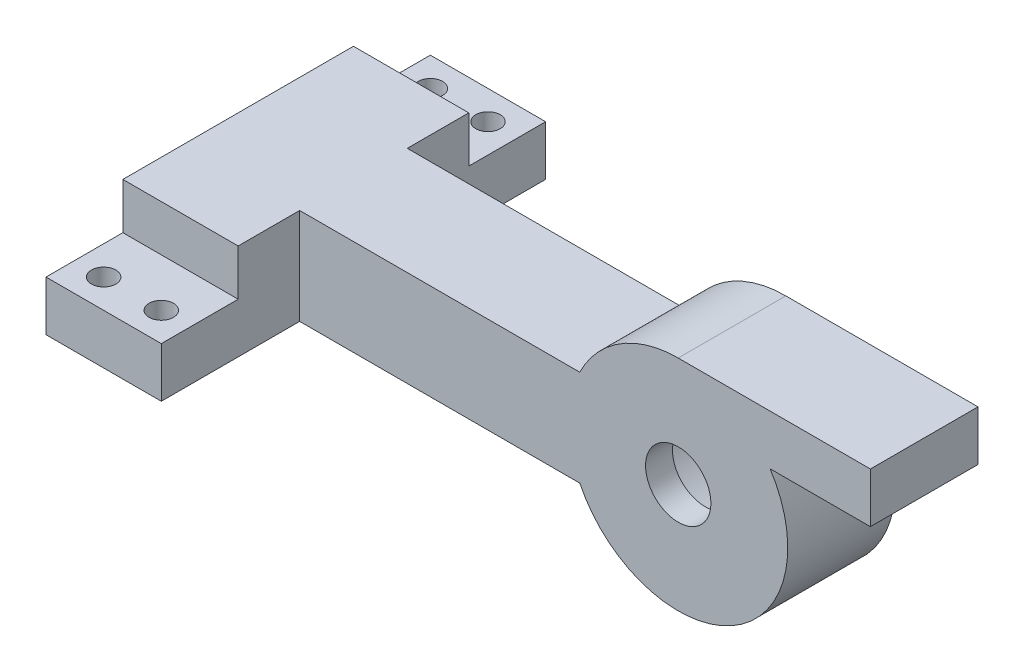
from build123d import *

# Parameters (mm, degrees)
SKETCH2_R               = 23.5
BOSS_EXTRUDE4_DEPTH     = 14
SKETCH5_R               = 23.5
SKETCH5_R_2             = 8.5
BOSS_EXTRUDE5_DEPTH     = 7
SKETCH8_W               = 30
SKETCH8_H               = 25
BOSS_EXTRUDE6_DEPTH     = 50
CUT_EXTRUDE1_DEPTH      = 143.513157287
CUT_EXTRUDE1_DEPTH_BACK = 143.513157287
SKETCH9_W               = 20
SKETCH9_H               = 12
SKETCH10_R              = 3.175
CUT_EXTRUDE2_DEPTH      = 168.302121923
BOSS_EXTRUDE8_DEPTH     = 28


with BuildPart() as part:
    # Sketch2 → Boss-Extrude4 (new, symmetric)
    with BuildSketch(Plane.XY):
        with BuildLine():
            Line((0, 0), (100, 0))
            Line((100, 0), (102.88750305, 0))
            ThreePointArc((102.88750305, 0), (157, 12.5), (102.88750305, 25))
            Line((102.88750305, 25), (100, 25))
            Line((100, 25), (0, 25))
            Line((0, 25), (0, 0))
        make_face()
        with Locations((128.5, 12.5)):
            Circle(SKETCH2_R, mode=Mode.SUBTRACT)
    extrude(amount=BOSS_EXTRUDE4_DEPTH, both=True)

    # Sketch8 → Boss-Extrude6 (add, symmetric)
    with BuildSketch(Plane.XY):
        with Locations((15, 12.5)):
            Rectangle(SKETCH8_W, SKETCH8_H)
    extrude(amount=BOSS_EXTRUDE6_DEPTH, both=True)

    # Sketch9 → Cut-Extrude1 (cut, two sides: drawn at the far end of the back side and taken through both)
    with BuildSketch(Plane(origin=(30, 0, 0), x_dir=(0, 0, -1), z_dir=(1, 0, 0)).offset(-CUT_EXTRUDE1_DEPTH_BACK)):
        with Locations((40, 19)):
            Rectangle(SKETCH9_W, SKETCH9_H)
        with Locations((-40, 19)):
            Rectangle(SKETCH9_W, SKETCH9_H)
    extrude(amount=CUT_EXTRUDE1_DEPTH + CUT_EXTRUDE1_DEPTH_BACK, mode=Mode.SUBTRACT)

    # Sketch10 → Cut-Extrude2 (cut, through all)
    with BuildSketch(Plane(origin=(0, 13, 0), x_dir=(1, 0, 0), z_dir=(0, 1, 0))):
        with Locations(Location((7.5, 42.5, 0), (0, 0, 270))):
            Circle(SKETCH10_R)
        with Locations(Location((22.5, 42.5, 0), (0, 0, 270))):
            Circle(SKETCH10_R)
        with Locations(Location((22.5, -42.5, 0), (0, 0, 270))):
            Circle(SKETCH10_R)
        with Locations(Location((7.5, -42.5, 0), (0, 0, 270))):
            Circle(SKETCH10_R)
    extrude(amount=-CUT_EXTRUDE2_DEPTH, mode=Mode.SUBTRACT)


with BuildPart() as body_2:
    # Sketch5 → Boss-Extrude5 (new body)
    with BuildSketch(Plane.XY.offset(14)):
        with Locations((128.5, 12.5)):
            Circle(SKETCH5_R)
        with Locations((128.5, 12.5)):
            Circle(SKETCH5_R_2, mode=Mode.SUBTRACT)
    extrude(amount=-BOSS_EXTRUDE5_DEPTH)


    add(part.part)  # Boss-Extrude8 merges part
    # Sketch12 → Boss-Extrude8 (add)
    with BuildSketch(Plane.XY.offset(14)):
        with BuildLine():
            ThreePointArc((128.5, 41), (142.110657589, 37.539968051), (152.416521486, 28))
            Line((152.416521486, 28), (178.5, 28))
            Line((178.5, 28), (178.5, 41))
            Line((178.5, 41), (128.5, 41))
        make_face()
    extrude(amount=-BOSS_EXTRUDE8_DEPTH)


solid = body_2.part
